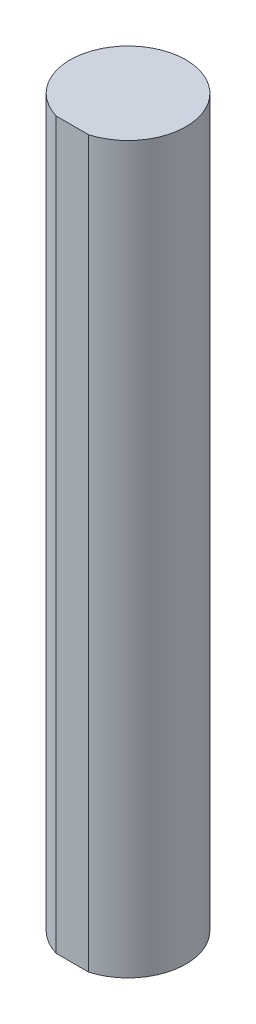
ISO-10303-21;
HEADER;
FILE_DESCRIPTION(('STEP AP214'),'2;1');
FILE_NAME('part.step','',(''),(''),'','','');
FILE_SCHEMA(('AUTOMOTIVE_DESIGN { 1 0 10303 214 1 1 1 1 }'));
ENDSEC;
DATA;
#1=APPLICATION_CONTEXT('core data for automotive mechanical design processes');
#2=APPLICATION_PROTOCOL_DEFINITION('international standard','automotive_design',2000,#1);
#3=PRODUCT_CONTEXT('',#1,'mechanical');
#4=PRODUCT('Part','Part','',(#3));
#5=PRODUCT_RELATED_PRODUCT_CATEGORY('part','',(#4));
#6=PRODUCT_DEFINITION_FORMATION('','',#4);
#7=PRODUCT_DEFINITION_CONTEXT('part definition',#1,'design');
#8=PRODUCT_DEFINITION('design','',#6,#7);
#9=PRODUCT_DEFINITION_SHAPE('','',#8);
#10=(LENGTH_UNIT() NAMED_UNIT(*) SI_UNIT(.MILLI.,.METRE.));
#11=(NAMED_UNIT(*) PLANE_ANGLE_UNIT() SI_UNIT($,.RADIAN.));
#12=(NAMED_UNIT(*) SI_UNIT($,.STERADIAN.) SOLID_ANGLE_UNIT());
#13=UNCERTAINTY_MEASURE_WITH_UNIT(LENGTH_MEASURE(1.E-05),#10,'distance_accuracy_value','');
#14=(GEOMETRIC_REPRESENTATION_CONTEXT(3) GLOBAL_UNCERTAINTY_ASSIGNED_CONTEXT((#13)) GLOBAL_UNIT_ASSIGNED_CONTEXT((#10,
#11,#12)) REPRESENTATION_CONTEXT('',''));
#15=CARTESIAN_POINT('',(0.,0.,0.));
#16=DIRECTION('',(0.,0.,1.));
#17=DIRECTION('',(1.,0.,0.));
#18=AXIS2_PLACEMENT_3D('',#15,#16,#17);
#19=CARTESIAN_POINT('',(0.,39.751,0.));
#20=DIRECTION('',(0.,-1.,0.));
#21=DIRECTION('',(0.,0.,-1.));
#22=AXIS2_PLACEMENT_3D('',#19,#20,#21);
#23=CYLINDRICAL_SURFACE('',#22,3.175);
#24=CARTESIAN_POINT('',(0.,39.751,0.));
#25=DIRECTION('',(0.,1.,0.));
#26=DIRECTION('',(0.,0.,1.));
#27=AXIS2_PLACEMENT_3D('',#24,#25,#26);
#28=CIRCLE('',#27,3.175);
#29=CARTESIAN_POINT('',(0.889,39.751,3.048));
#30=VERTEX_POINT('',#29);
#31=CARTESIAN_POINT('',(-0.889,39.751,3.048));
#32=VERTEX_POINT('',#31);
#33=EDGE_CURVE('E41',#30,#32,#28,.T.);
#34=ORIENTED_EDGE('',*,*,#33,.F.);
#35=DIRECTION('',(0.,-1.,0.));
#36=VECTOR('',#35,1.);
#37=CARTESIAN_POINT('',(0.889,39.751,3.048));
#38=LINE('',#37,#36);
#39=CARTESIAN_POINT('',(0.889,0.,3.048));
#40=VERTEX_POINT('',#39);
#41=EDGE_CURVE('E52',#30,#40,#38,.T.);
#42=ORIENTED_EDGE('',*,*,#41,.T.);
#43=CARTESIAN_POINT('',(0.,0.,0.));
#44=DIRECTION('',(0.,1.,0.));
#45=DIRECTION('',(0.,0.,1.));
#46=AXIS2_PLACEMENT_3D('',#43,#44,#45);
#47=CIRCLE('',#46,3.175);
#48=CARTESIAN_POINT('',(-0.889,0.,3.048));
#49=VERTEX_POINT('',#48);
#50=EDGE_CURVE('E63',#40,#49,#47,.T.);
#51=ORIENTED_EDGE('',*,*,#50,.T.);
#52=DIRECTION('',(0.,-1.,0.));
#53=VECTOR('',#52,1.);
#54=CARTESIAN_POINT('',(-0.889,39.751,3.048));
#55=LINE('',#54,#53);
#56=EDGE_CURVE('E48',#49,#32,#55,.F.);
#57=ORIENTED_EDGE('',*,*,#56,.T.);
#58=EDGE_LOOP('',(#34,#42,#51,#57));
#59=FACE_BOUND('',#58,.T.);
#60=ADVANCED_FACE('F34',(#59),#23,.T.);
#61=CARTESIAN_POINT('',(0.,39.751,0.));
#62=DIRECTION('',(0.,1.,0.));
#63=DIRECTION('',(0.,0.,1.));
#64=AXIS2_PLACEMENT_3D('',#61,#62,#63);
#65=PLANE('',#64);
#66=DIRECTION('',(1.,0.,0.));
#67=VECTOR('',#66,1.);
#68=CARTESIAN_POINT('',(-2.6633023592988,39.751,3.048));
#69=LINE('',#68,#67);
#70=EDGE_CURVE('E70',#32,#30,#69,.T.);
#71=ORIENTED_EDGE('',*,*,#70,.T.);
#72=ORIENTED_EDGE('',*,*,#33,.T.);
#73=EDGE_LOOP('',(#71,#72));
#74=FACE_BOUND('',#73,.T.);
#75=ADVANCED_FACE('F72',(#74),#65,.T.);
#76=CARTESIAN_POINT('',(0.,0.,0.));
#77=DIRECTION('',(0.,1.,0.));
#78=DIRECTION('',(0.,0.,1.));
#79=AXIS2_PLACEMENT_3D('',#76,#77,#78);
#80=PLANE('',#79);
#81=ORIENTED_EDGE('',*,*,#50,.F.);
#82=DIRECTION('',(-1.,0.,0.));
#83=VECTOR('',#82,1.);
#84=CARTESIAN_POINT('',(0.,0.,3.048));
#85=LINE('',#84,#83);
#86=EDGE_CURVE('E11',#40,#49,#85,.T.);
#87=ORIENTED_EDGE('',*,*,#86,.T.);
#88=EDGE_LOOP('',(#81,#87));
#89=FACE_BOUND('',#88,.T.);
#90=ADVANCED_FACE('F66',(#89),#80,.F.);
#91=CARTESIAN_POINT('',(-2.6633023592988,39.751,3.048));
#92=DIRECTION('',(0.,0.,-1.));
#93=DIRECTION('',(-1.,0.,0.));
#94=AXIS2_PLACEMENT_3D('',#91,#92,#93);
#95=PLANE('',#94);
#96=ORIENTED_EDGE('',*,*,#70,.F.);
#97=ORIENTED_EDGE('',*,*,#56,.F.);
#98=ORIENTED_EDGE('',*,*,#86,.F.);
#99=ORIENTED_EDGE('',*,*,#41,.F.);
#100=EDGE_LOOP('',(#96,#97,#98,#99));
#101=FACE_BOUND('',#100,.T.);
#102=ADVANCED_FACE('F57',(#101),#95,.F.);
#103=CLOSED_SHELL('',(#60,#75,#90,#102));
#104=MANIFOLD_SOLID_BREP('B2',#103);
#105=ADVANCED_BREP_SHAPE_REPRESENTATION('',(#18,#104),#14);
#106=SHAPE_DEFINITION_REPRESENTATION(#9,#105);
ENDSEC;
END-ISO-10303-21;
